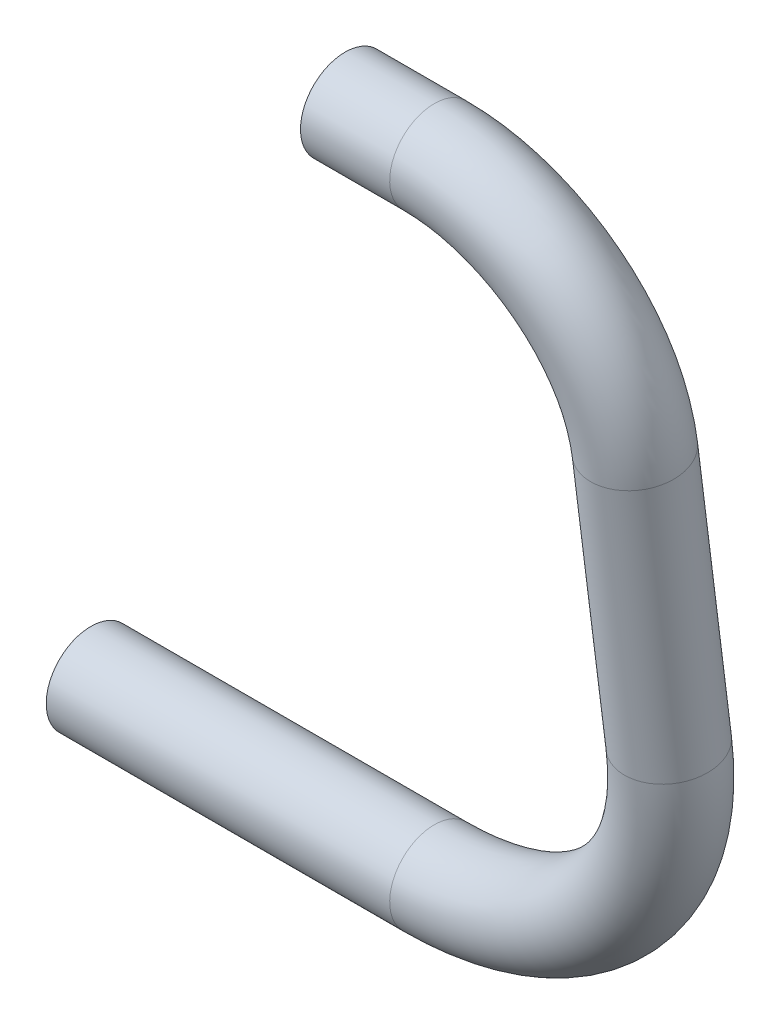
ISO-10303-21;
HEADER;
FILE_DESCRIPTION(('STEP AP214'),'2;1');
FILE_NAME('part.step','',(''),(''),'','','');
FILE_SCHEMA(('AUTOMOTIVE_DESIGN { 1 0 10303 214 1 1 1 1 }'));
ENDSEC;
DATA;
#1=APPLICATION_CONTEXT('core data for automotive mechanical design processes');
#2=APPLICATION_PROTOCOL_DEFINITION('international standard','automotive_design',2000,#1);
#3=PRODUCT_CONTEXT('',#1,'mechanical');
#4=PRODUCT('Part','Part','',(#3));
#5=PRODUCT_RELATED_PRODUCT_CATEGORY('part','',(#4));
#6=PRODUCT_DEFINITION_FORMATION('','',#4);
#7=PRODUCT_DEFINITION_CONTEXT('part definition',#1,'design');
#8=PRODUCT_DEFINITION('design','',#6,#7);
#9=PRODUCT_DEFINITION_SHAPE('','',#8);
#10=(LENGTH_UNIT() NAMED_UNIT(*) SI_UNIT(.MILLI.,.METRE.));
#11=(NAMED_UNIT(*) PLANE_ANGLE_UNIT() SI_UNIT($,.RADIAN.));
#12=(NAMED_UNIT(*) SI_UNIT($,.STERADIAN.) SOLID_ANGLE_UNIT());
#13=UNCERTAINTY_MEASURE_WITH_UNIT(LENGTH_MEASURE(1.E-05),#10,'distance_accuracy_value','');
#14=(GEOMETRIC_REPRESENTATION_CONTEXT(3) GLOBAL_UNCERTAINTY_ASSIGNED_CONTEXT((#13)) GLOBAL_UNIT_ASSIGNED_CONTEXT((#10,
#11,#12)) REPRESENTATION_CONTEXT('',''));
#15=CARTESIAN_POINT('',(0.,0.,0.));
#16=DIRECTION('',(0.,0.,1.));
#17=DIRECTION('',(1.,0.,0.));
#18=AXIS2_PLACEMENT_3D('',#15,#16,#17);
#19=CARTESIAN_POINT('',(30.7975,50.8,6.35000000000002));
#20=DIRECTION('',(-1.,0.,0.));
#21=DIRECTION('',(0.,0.,1.));
#22=AXIS2_PLACEMENT_3D('',#19,#20,#21);
#23=CYLINDRICAL_SURFACE('',#22,3.175);
#24=CARTESIAN_POINT('',(30.7975,50.8,6.35000000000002));
#25=DIRECTION('',(-1.,0.,0.));
#26=DIRECTION('',(0.,0.246153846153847,-0.96923076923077));
#27=AXIS2_PLACEMENT_3D('',#24,#25,#26);
#28=CIRCLE('',#27,3.175);
#29=CARTESIAN_POINT('',(30.7975,53.9504822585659,6.74381028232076));
#30=VERTEX_POINT('',#29);
#31=EDGE_CURVE('E30',#30,#30,#28,.T.);
#32=ORIENTED_EDGE('',*,*,#31,.T.);
#33=EDGE_LOOP('',(#32));
#34=FACE_BOUND('',#33,.T.);
#35=CARTESIAN_POINT('',(24.4475,50.8,6.35000000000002));
#36=DIRECTION('',(-1.,0.,0.));
#37=DIRECTION('',(0.,0.246153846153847,-0.96923076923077));
#38=AXIS2_PLACEMENT_3D('',#35,#36,#37);
#39=CIRCLE('',#38,3.175);
#40=CARTESIAN_POINT('',(24.4475,51.5815384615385,3.27269230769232));
#41=VERTEX_POINT('',#40);
#42=EDGE_CURVE('E10',#41,#41,#39,.T.);
#43=ORIENTED_EDGE('',*,*,#42,.F.);
#44=EDGE_LOOP('',(#43));
#45=FACE_BOUND('',#44,.T.);
#46=ADVANCED_FACE('F24',(#34,#45),#23,.T.);
#47=CARTESIAN_POINT('',(30.7975,38.1980709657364,4.77475887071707));
#48=DIRECTION('',(0.,-0.124034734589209,0.992277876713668));
#49=DIRECTION('',(0.,-0.992277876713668,-0.124034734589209));
#50=AXIS2_PLACEMENT_3D('',#47,#48,#49);
#51=TOROIDAL_SURFACE('',#50,12.7,3.175);
#52=CARTESIAN_POINT('',(43.4975,38.1980709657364,4.77475887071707));
#53=DIRECTION('',(0.,0.992277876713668,0.124034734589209));
#54=DIRECTION('',(0.124034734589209,0.123076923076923,-0.984615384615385));
#55=AXIS2_PLACEMENT_3D('',#52,#53,#54);
#56=CIRCLE('',#55,3.175);
#57=CARTESIAN_POINT('',(46.6725,38.1980709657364,4.77475887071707));
#58=VERTEX_POINT('',#57);
#59=EDGE_CURVE('E34',#58,#58,#56,.T.);
#60=CARTESIAN_POINT('',(30.7975,38.1980709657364,4.77475887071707));
#61=DIRECTION('',(0.,-0.124034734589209,0.992277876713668));
#62=DIRECTION('',(0.,-0.992277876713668,-0.124034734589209));
#63=AXIS2_PLACEMENT_3D('',#60,#61,#62);
#64=CIRCLE('',#63,15.875);
#65=EDGE_CURVE('',#58,#30,#64,.T.);
#66=ORIENTED_EDGE('',*,*,#59,.T.);
#67=ORIENTED_EDGE('',*,*,#31,.F.);
#68=ORIENTED_EDGE('',*,*,#65,.T.);
#69=ORIENTED_EDGE('',*,*,#65,.F.);
#70=EDGE_LOOP('',(#66,#68,#67,#69));
#71=FACE_BOUND('',#70,.T.);
#72=ADVANCED_FACE('F61',(#71),#51,.T.);
#73=CARTESIAN_POINT('',(43.4975,18.9028935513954,2.36286169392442));
#74=DIRECTION('',(0.,0.992277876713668,0.124034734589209));
#75=DIRECTION('',(0.,-0.124034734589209,0.992277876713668));
#76=AXIS2_PLACEMENT_3D('',#73,#74,#75);
#77=CYLINDRICAL_SURFACE('',#76,3.175);
#78=CARTESIAN_POINT('',(43.4975,18.9028935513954,2.36286169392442));
#79=DIRECTION('',(0.,0.992277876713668,0.124034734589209));
#80=DIRECTION('',(0.124034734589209,0.123076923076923,-0.984615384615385));
#81=AXIS2_PLACEMENT_3D('',#78,#79,#80);
#82=CIRCLE('',#81,3.175);
#83=CARTESIAN_POINT('',(46.6725,18.9028935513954,2.36286169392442));
#84=VERTEX_POINT('',#83);
#85=EDGE_CURVE('E38',#84,#84,#82,.T.);
#86=ORIENTED_EDGE('',*,*,#85,.T.);
#87=EDGE_LOOP('',(#86));
#88=FACE_BOUND('',#87,.T.);
#89=ORIENTED_EDGE('',*,*,#59,.F.);
#90=EDGE_LOOP('',(#89));
#91=FACE_BOUND('',#90,.T.);
#92=ADVANCED_FACE('F65',(#88,#91),#77,.T.);
#93=CARTESIAN_POINT('',(24.4475,18.9028935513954,2.36286169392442));
#94=DIRECTION('',(0.,-0.124034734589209,0.992277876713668));
#95=DIRECTION('',(0.,-0.992277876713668,-0.124034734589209));
#96=AXIS2_PLACEMENT_3D('',#93,#94,#95);
#97=TOROIDAL_SURFACE('',#96,19.05,3.175);
#98=CARTESIAN_POINT('',(24.4475,0.,0.));
#99=DIRECTION('',(1.,0.,0.));
#100=DIRECTION('',(0.,0.,-1.));
#101=AXIS2_PLACEMENT_3D('',#98,#99,#100);
#102=CIRCLE('',#101,3.175);
#103=CARTESIAN_POINT('',(24.4475,-3.1504822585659,-0.393810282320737));
#104=VERTEX_POINT('',#103);
#105=EDGE_CURVE('E43',#104,#104,#102,.T.);
#106=CARTESIAN_POINT('',(24.4475,18.9028935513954,2.36286169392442));
#107=DIRECTION('',(0.,-0.124034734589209,0.992277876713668));
#108=DIRECTION('',(0.,-0.992277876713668,-0.124034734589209));
#109=AXIS2_PLACEMENT_3D('',#106,#107,#108);
#110=CIRCLE('',#109,22.225);
#111=EDGE_CURVE('',#104,#84,#110,.T.);
#112=ORIENTED_EDGE('',*,*,#105,.T.);
#113=ORIENTED_EDGE('',*,*,#85,.F.);
#114=ORIENTED_EDGE('',*,*,#111,.T.);
#115=ORIENTED_EDGE('',*,*,#111,.F.);
#116=EDGE_LOOP('',(#112,#114,#113,#115));
#117=FACE_BOUND('',#116,.T.);
#118=ADVANCED_FACE('F71',(#117),#97,.T.);
#119=CARTESIAN_POINT('',(24.4475,0.,0.));
#120=DIRECTION('',(-1.,0.,0.));
#121=DIRECTION('',(0.,0.,1.));
#122=AXIS2_PLACEMENT_3D('',#119,#120,#121);
#123=CYLINDRICAL_SURFACE('',#122,3.175);
#124=ORIENTED_EDGE('',*,*,#105,.F.);
#125=EDGE_LOOP('',(#124));
#126=FACE_BOUND('',#125,.T.);
#127=CARTESIAN_POINT('',(0.,0.,0.));
#128=DIRECTION('',(1.,0.,0.));
#129=DIRECTION('',(0.,0.,-1.));
#130=AXIS2_PLACEMENT_3D('',#127,#128,#129);
#131=CIRCLE('',#130,3.175);
#132=CARTESIAN_POINT('',(0.,0.,-3.175));
#133=VERTEX_POINT('',#132);
#134=EDGE_CURVE('E46',#133,#133,#131,.T.);
#135=ORIENTED_EDGE('',*,*,#134,.T.);
#136=EDGE_LOOP('',(#135));
#137=FACE_BOUND('',#136,.T.);
#138=ADVANCED_FACE('F50',(#126,#137),#123,.T.);
#139=CARTESIAN_POINT('',(24.4475,50.8,6.35000000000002));
#140=DIRECTION('',(-1.,0.,0.));
#141=DIRECTION('',(0.,0.246153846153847,-0.96923076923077));
#142=AXIS2_PLACEMENT_3D('',#139,#140,#141);
#143=PLANE('',#142);
#144=ORIENTED_EDGE('',*,*,#42,.T.);
#145=EDGE_LOOP('',(#144));
#146=FACE_BOUND('',#145,.T.);
#147=ADVANCED_FACE('F54',(#146),#143,.T.);
#148=CARTESIAN_POINT('',(0.,0.,0.));
#149=DIRECTION('',(1.,0.,0.));
#150=DIRECTION('',(0.,0.,-1.));
#151=AXIS2_PLACEMENT_3D('',#148,#149,#150);
#152=PLANE('',#151);
#153=ORIENTED_EDGE('',*,*,#134,.F.);
#154=EDGE_LOOP('',(#153));
#155=FACE_BOUND('',#154,.T.);
#156=ADVANCED_FACE('F52',(#155),#152,.F.);
#157=CLOSED_SHELL('',(#46,#72,#92,#118,#138,#147,#156));
#158=MANIFOLD_SOLID_BREP('B2',#157);
#159=ADVANCED_BREP_SHAPE_REPRESENTATION('',(#18,#158),#14);
#160=SHAPE_DEFINITION_REPRESENTATION(#9,#159);
ENDSEC;
END-ISO-10303-21;
